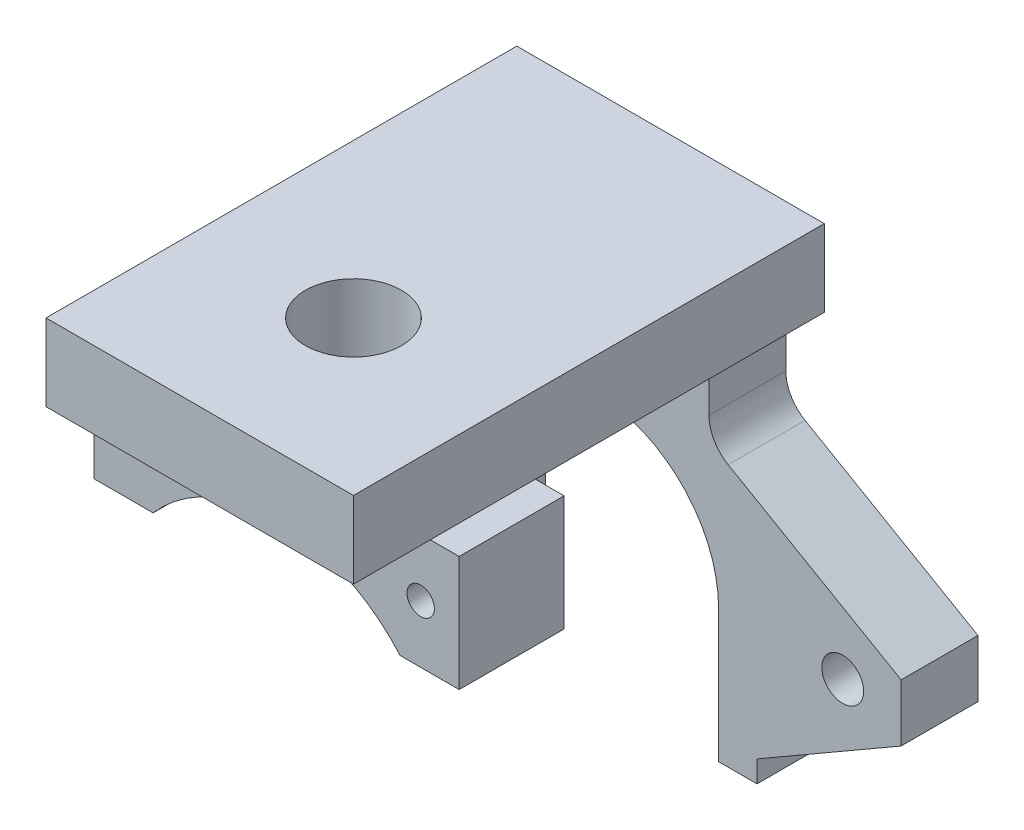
from build123d import *

# Parameters (mm, degrees)
EXTRUDE1_DEPTH            = 25.4
CUT_EXTRUDE1_REACH        = 95.1
SKETCH6_W                 = 12.7
SKETCH6_H                 = 75.438
CUT_EXTRUDE2_DEPTH        = 91.797650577
EXTRUDE2_DEPTH            = 2.38125
EXTRUDE2_DEPTH_BACK       = 27.78125
SKETCH7_W                 = 8.6741
SKETCH7_H                 = 9.525
CUT_EXTRUDE4_REACH        = 68.358
SKETCH11_R                = 13.49375
F_4_40_TAPPED_HOLE1_D     = 2.2606
F_4_40_TAPPED_HOLE1_DEPTH = 8.6741
F_8_32_TAPPED_HOLE4_D     = 3.4544
F_8_32_TAPPED_HOLE4_DEPTH = 6.77545
CUT_EXTRUDE3_REACH        = 90.093
SKETCH8_R                 = 3.96875
F_10_32_TAPPED_HOLE1_D    = 4.0386
CUT_EXTRUDE5_REACH        = 95.1
SKETCH17_W                = 25.4
SKETCH17_H                = 42.89425
CUT_EXTRUDE6_DEPTH        = 78.74


with BuildPart() as part:
    # Sketch1 → Extrude1 (new, symmetric)
    with BuildSketch(Plane(origin=(0, 0, 0), x_dir=(0, 0, -1), z_dir=(1, 0, 0))):
        Polygon((0, 0), (-81.788, 0), (-81.788, -6.35), (-6.35, -6.35), (-6.35, -36.5125), (0, -36.5125), align=None)
    extrude(amount=EXTRUDE1_DEPTH, both=True)

    # Sketch2 → Cut-Extrude1 (cut, up to next)
    with BuildSketch(Plane(origin=(0, 0, 0), x_dir=(-1, 0, 0), z_dir=(0, 0, -1)), mode=Mode.PRIVATE) as cut_extrude1_sk1:
        with BuildLine():
            Line((-10.31875, -25.5016), (-10.31875, -41.376576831))
            Line((-10.31875, -41.376576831), (10.31875, -41.376576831))
            Line((10.31875, -41.376576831), (10.31875, -25.5016))
            ThreePointArc((10.31875, -25.5016), (0, -15.18285), (-10.31875, -25.5016))
        make_face()
    cut_extrude1_tool1 = extrude(cut_extrude1_sk1.sketch, amount=-CUT_EXTRUDE1_REACH, mode=Mode.PRIVATE) & part.part
    add(cut_extrude1_tool1.solids().sort_by_distance((0, -29.276324, 0))[0], mode=Mode.SUBTRACT)

    # Sketch6 → Cut-Extrude2 (cut, through all)
    with BuildSketch(Plane.XZ.offset(6.35)):
        with Locations((19.05, 44.069)):
            Rectangle(SKETCH6_W, SKETCH6_H)
        with Locations((-19.05, 44.069)):
            Rectangle(SKETCH6_W, SKETCH6_H)
    extrude(amount=-CUT_EXTRUDE2_DEPTH, mode=Mode.SUBTRACT)

    # Sketch7 → Extrude2 (add, two sides: drawn at the far end of the back side and taken through both)
    with BuildSketch(Plane(origin=(12.7, 0, 0), x_dir=(0, 0, -1), z_dir=(1, 0, 0)).offset(-EXTRUDE2_DEPTH_BACK)):
        with Locations((-28.2067, -11.1125)):
            Rectangle(SKETCH7_W, SKETCH7_H)
    extrude(amount=EXTRUDE2_DEPTH + EXTRUDE2_DEPTH_BACK)

    # Sketch11 → Cut-Extrude4 (cut, up to next)
    with BuildSketch(Plane.XY.offset(32.54375), mode=Mode.PRIVATE) as cut_extrude4_sk1:
        with Locations((0, -24.70785)):
            Circle(SKETCH11_R)
    cut_extrude4_tool1 = extrude(cut_extrude4_sk1.sketch, amount=-CUT_EXTRUDE4_REACH, mode=Mode.PRIVATE) & part.part
    add(cut_extrude4_tool1.solids().sort_by_distance((0, -24.70785, 32.54375))[0], mode=Mode.SUBTRACT)

    # 4-40 Tapped Hole1
    with Locations(Plane.XY.offset(32.54375)):
        with Locations((-11.90625, -11.1125), (11.90625, -11.1125)):
            Hole(F_4_40_TAPPED_HOLE1_D / 2, depth=F_4_40_TAPPED_HOLE1_DEPTH)

    # 8-32 Tapped Hole4
    with Locations(Plane(origin=(20.57399608, -25.4889, 0), x_dir=(0, -1, 0), z_dir=(0, 0, -1))):
        with Locations((0, 0), (0, 41.148)):
            Hole(F_8_32_TAPPED_HOLE4_D / 2, depth=F_8_32_TAPPED_HOLE4_DEPTH)

    # Sketch8 → Cut-Extrude3 (cut, up to next)
    with BuildSketch(Plane.XZ.offset(15.875), mode=Mode.PRIVATE) as cut_extrude3_sk1:
        with Locations(Location((0, 26.19375, 0), (0, 0, 324.154611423))):
            Circle(SKETCH8_R)
    cut_extrude3_tool1 = extrude(cut_extrude3_sk1.sketch, amount=-CUT_EXTRUDE3_REACH, mode=Mode.PRIVATE) & part.part
    add(cut_extrude3_tool1.solids().sort_by_distance((0, -15.875, 26.19375))[0], mode=Mode.SUBTRACT)

    # 10-32 Tapped Hole1 (through all)
    with Locations(Plane(origin=(0, 0, 0), x_dir=(-1, 0, 0), z_dir=(0, 1, 0))):
        with Locations((0, 72.263), (0, 50.038)):
            Hole(F_10_32_TAPPED_HOLE1_D / 2)

    # Sketch12 → Cut-Extrude5 (cut, up to next)
    with BuildSketch(Plane.XY, mode=Mode.PRIVATE) as cut_extrude5_sk1:
        with BuildLine():
            Line((12.7, 0), (12.7, -6.35))
            ThreePointArc((12.7, -6.35), (10.45493597, -7.27993597), (9.525, -9.525))
            Line((9.525, -9.525), (9.525, -12.118934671))
            ThreePointArc((9.525, -12.118934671), (9.950369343, -13.706434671), (11.1125, -14.868565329))
            Line((11.1125, -14.868565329), (25.4, -23.1174573))
            Line((25.4, -23.1174573), (25.4, 0))
            Line((25.4, 0), (12.7, 0))
        make_face()
    cut_extrude5_tool1 = extrude(cut_extrude5_sk1.sketch, amount=CUT_EXTRUDE5_REACH, mode=Mode.PRIVATE) & part.part
    # Sketch12 → Cut-Extrude5 (cut, up to next)
    with BuildSketch(Plane.XY, mode=Mode.PRIVATE) as cut_extrude5_sk2:
        Polygon((25.4, -27.8511), (13.49375, -34.725176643), (13.49375, -36.5125), (25.4, -36.5125), align=None)
    cut_extrude5_tool2 = extrude(cut_extrude5_sk2.sketch, amount=CUT_EXTRUDE5_REACH, mode=Mode.PRIVATE) & part.part
    # Sketch12 → Cut-Extrude5 (cut, up to next)
    with BuildSketch(Plane.XY, mode=Mode.PRIVATE) as cut_extrude5_sk3:
        Polygon((-13.49375, -34.725176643), (-13.49375, -36.5125), (-25.4, -36.5125), (-25.4, -27.8511), align=None)
    cut_extrude5_tool3 = extrude(cut_extrude5_sk3.sketch, amount=CUT_EXTRUDE5_REACH, mode=Mode.PRIVATE) & part.part
    # Sketch12 → Cut-Extrude5 (cut, up to next)
    with BuildSketch(Plane.XY, mode=Mode.PRIVATE) as cut_extrude5_sk4:
        with BuildLine():
            Line((-25.4, -23.1174573), (-11.1125, -14.868565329))
            ThreePointArc((-11.1125, -14.868565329), (-9.950369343, -13.706434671), (-9.525, -12.118934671))
            Line((-9.525, -12.118934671), (-9.525, -9.525))
            ThreePointArc((-9.525, -9.525), (-10.45493597, -7.27993597), (-12.7, -6.35))
            Line((-12.7, -6.35), (-12.7, 0))
            Line((-12.7, 0), (-25.4, 0))
            Line((-25.4, 0), (-25.4, -23.1174573))
        make_face()
    cut_extrude5_tool4 = extrude(cut_extrude5_sk4.sketch, amount=CUT_EXTRUDE5_REACH, mode=Mode.PRIVATE) & part.part
    add(cut_extrude5_tool1.solids().sort_by_distance((18.716376, -9.933386, 0))[0], mode=Mode.SUBTRACT)
    add(cut_extrude5_tool2.solids().sort_by_distance((20.752369, -33.523455, 0))[0], mode=Mode.SUBTRACT)
    add(cut_extrude5_tool3.solids().sort_by_distance((-20.752369, -33.523455, 0))[0], mode=Mode.SUBTRACT)
    add(cut_extrude5_tool4.solids().sort_by_distance((-18.716376, -9.933386, 0))[0], mode=Mode.SUBTRACT)

    # Sketch17 → Cut-Extrude6 (cut)
    with BuildSketch(Plane.XZ.offset(6.35)):
        with Locations((0, 60.340875)):
            Rectangle(SKETCH17_W, SKETCH17_H)
    extrude(amount=-CUT_EXTRUDE6_DEPTH, mode=Mode.SUBTRACT)


solid = part.part
